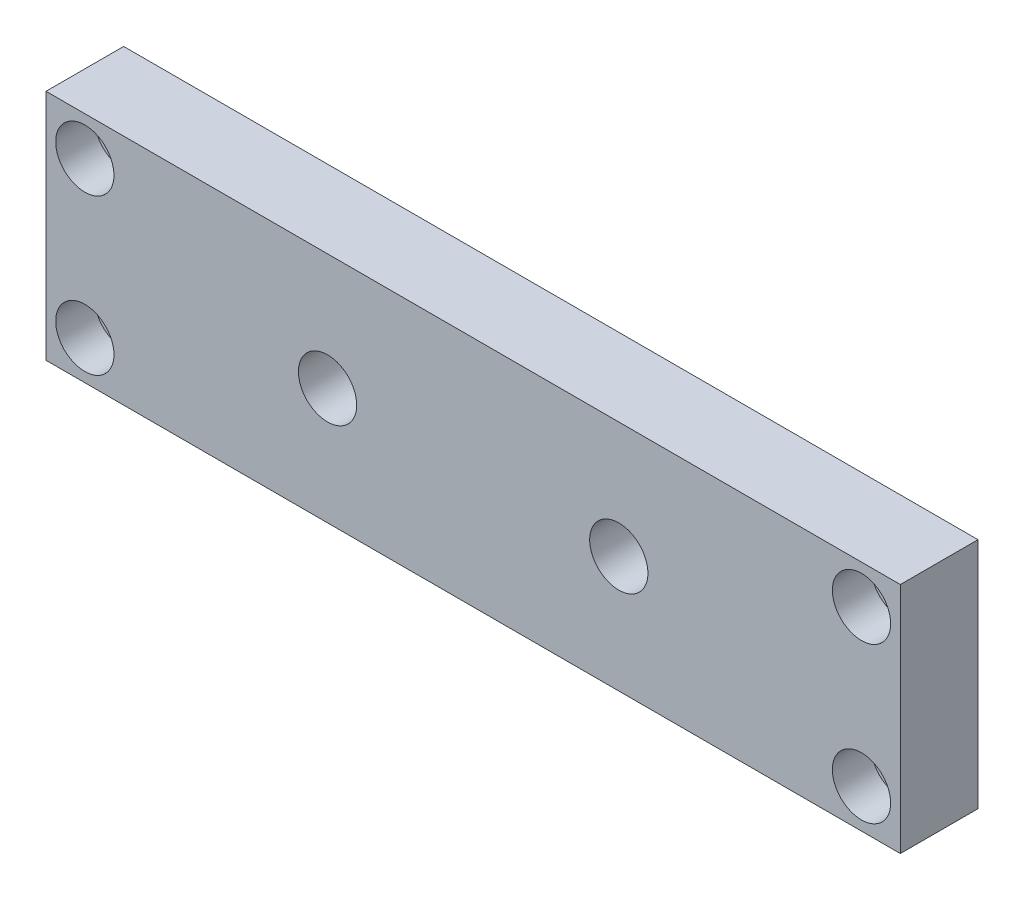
ISO-10303-21;
HEADER;
FILE_DESCRIPTION(('STEP AP214'),'2;1');
FILE_NAME('part.step','',(''),(''),'','','');
FILE_SCHEMA(('AUTOMOTIVE_DESIGN { 1 0 10303 214 1 1 1 1 }'));
ENDSEC;
DATA;
#1=APPLICATION_CONTEXT('core data for automotive mechanical design processes');
#2=APPLICATION_PROTOCOL_DEFINITION('international standard','automotive_design',2000,#1);
#3=PRODUCT_CONTEXT('',#1,'mechanical');
#4=PRODUCT('Part','Part','',(#3));
#5=PRODUCT_RELATED_PRODUCT_CATEGORY('part','',(#4));
#6=PRODUCT_DEFINITION_FORMATION('','',#4);
#7=PRODUCT_DEFINITION_CONTEXT('part definition',#1,'design');
#8=PRODUCT_DEFINITION('design','',#6,#7);
#9=PRODUCT_DEFINITION_SHAPE('','',#8);
#10=(LENGTH_UNIT() NAMED_UNIT(*) SI_UNIT(.MILLI.,.METRE.));
#11=(NAMED_UNIT(*) PLANE_ANGLE_UNIT() SI_UNIT($,.RADIAN.));
#12=(NAMED_UNIT(*) SI_UNIT($,.STERADIAN.) SOLID_ANGLE_UNIT());
#13=UNCERTAINTY_MEASURE_WITH_UNIT(LENGTH_MEASURE(1.E-05),#10,'distance_accuracy_value','');
#14=(GEOMETRIC_REPRESENTATION_CONTEXT(3) GLOBAL_UNCERTAINTY_ASSIGNED_CONTEXT((#13)) GLOBAL_UNIT_ASSIGNED_CONTEXT((#10,
#11,#12)) REPRESENTATION_CONTEXT('',''));
#15=CARTESIAN_POINT('',(0.,0.,0.));
#16=DIRECTION('',(0.,0.,1.));
#17=DIRECTION('',(1.,0.,0.));
#18=AXIS2_PLACEMENT_3D('',#15,#16,#17);
#19=CARTESIAN_POINT('',(63.5,12.7,12.7));
#20=DIRECTION('',(0.,0.,-1.));
#21=DIRECTION('',(-1.,0.,0.));
#22=AXIS2_PLACEMENT_3D('',#19,#20,#21);
#23=CYLINDRICAL_SURFACE('',#22,3.175);
#24=CARTESIAN_POINT('',(63.5,12.7,0.));
#25=DIRECTION('',(0.,0.,1.));
#26=DIRECTION('',(1.,0.,0.));
#27=AXIS2_PLACEMENT_3D('',#24,#25,#26);
#28=CIRCLE('',#27,3.175);
#29=CARTESIAN_POINT('',(66.675,12.7,0.));
#30=VERTEX_POINT('',#29);
#31=EDGE_CURVE('E214',#30,#30,#28,.T.);
#32=ORIENTED_EDGE('',*,*,#31,.F.);
#33=EDGE_LOOP('',(#32));
#34=FACE_BOUND('',#33,.T.);
#35=CARTESIAN_POINT('',(63.5,12.7,6.35));
#36=DIRECTION('',(0.,0.,1.));
#37=DIRECTION('',(1.,0.,0.));
#38=AXIS2_PLACEMENT_3D('',#35,#36,#37);
#39=CIRCLE('',#38,3.175);
#40=CARTESIAN_POINT('',(66.675,12.7,6.35));
#41=VERTEX_POINT('',#40);
#42=EDGE_CURVE('E127',#41,#41,#39,.T.);
#43=ORIENTED_EDGE('',*,*,#42,.T.);
#44=EDGE_LOOP('',(#43));
#45=FACE_BOUND('',#44,.T.);
#46=ADVANCED_FACE('F33',(#34,#45),#23,.F.);
#47=CARTESIAN_POINT('',(63.5,-12.7,12.7));
#48=DIRECTION('',(0.,0.,-1.));
#49=DIRECTION('',(-1.,0.,0.));
#50=AXIS2_PLACEMENT_3D('',#47,#48,#49);
#51=CYLINDRICAL_SURFACE('',#50,3.175);
#52=CARTESIAN_POINT('',(63.5,-12.7,0.));
#53=DIRECTION('',(0.,0.,1.));
#54=DIRECTION('',(1.,0.,0.));
#55=AXIS2_PLACEMENT_3D('',#52,#53,#54);
#56=CIRCLE('',#55,3.175);
#57=CARTESIAN_POINT('',(66.675,-12.7,0.));
#58=VERTEX_POINT('',#57);
#59=EDGE_CURVE('E197',#58,#58,#56,.T.);
#60=ORIENTED_EDGE('',*,*,#59,.F.);
#61=EDGE_LOOP('',(#60));
#62=FACE_BOUND('',#61,.T.);
#63=CARTESIAN_POINT('',(63.5,-12.7,6.35));
#64=DIRECTION('',(0.,0.,1.));
#65=DIRECTION('',(1.,0.,0.));
#66=AXIS2_PLACEMENT_3D('',#63,#64,#65);
#67=CIRCLE('',#66,3.175);
#68=CARTESIAN_POINT('',(66.675,-12.7,6.35));
#69=VERTEX_POINT('',#68);
#70=EDGE_CURVE('E122',#69,#69,#67,.T.);
#71=ORIENTED_EDGE('',*,*,#70,.T.);
#72=EDGE_LOOP('',(#71));
#73=FACE_BOUND('',#72,.T.);
#74=ADVANCED_FACE('F145',(#62,#73),#51,.F.);
#75=CARTESIAN_POINT('',(-63.5,-12.7,12.7));
#76=DIRECTION('',(0.,0.,-1.));
#77=DIRECTION('',(-1.,0.,0.));
#78=AXIS2_PLACEMENT_3D('',#75,#76,#77);
#79=CYLINDRICAL_SURFACE('',#78,3.175);
#80=CARTESIAN_POINT('',(-63.5,-12.7,0.));
#81=DIRECTION('',(0.,0.,1.));
#82=DIRECTION('',(1.,0.,0.));
#83=AXIS2_PLACEMENT_3D('',#80,#81,#82);
#84=CIRCLE('',#83,3.175);
#85=CARTESIAN_POINT('',(-60.325,-12.7,0.));
#86=VERTEX_POINT('',#85);
#87=EDGE_CURVE('E193',#86,#86,#84,.T.);
#88=ORIENTED_EDGE('',*,*,#87,.F.);
#89=EDGE_LOOP('',(#88));
#90=FACE_BOUND('',#89,.T.);
#91=CARTESIAN_POINT('',(-63.5,-12.7,6.35));
#92=DIRECTION('',(0.,0.,1.));
#93=DIRECTION('',(1.,0.,0.));
#94=AXIS2_PLACEMENT_3D('',#91,#92,#93);
#95=CIRCLE('',#94,3.175);
#96=CARTESIAN_POINT('',(-60.325,-12.7,6.35));
#97=VERTEX_POINT('',#96);
#98=EDGE_CURVE('E117',#97,#97,#95,.T.);
#99=ORIENTED_EDGE('',*,*,#98,.T.);
#100=EDGE_LOOP('',(#99));
#101=FACE_BOUND('',#100,.T.);
#102=ADVANCED_FACE('F152',(#90,#101),#79,.F.);
#103=CARTESIAN_POINT('',(-63.5,12.7,12.7));
#104=DIRECTION('',(0.,0.,-1.));
#105=DIRECTION('',(-1.,0.,0.));
#106=AXIS2_PLACEMENT_3D('',#103,#104,#105);
#107=CYLINDRICAL_SURFACE('',#106,3.175);
#108=CARTESIAN_POINT('',(-63.5,12.7,0.));
#109=DIRECTION('',(0.,0.,1.));
#110=DIRECTION('',(1.,0.,0.));
#111=AXIS2_PLACEMENT_3D('',#108,#109,#110);
#112=CIRCLE('',#111,3.175);
#113=CARTESIAN_POINT('',(-60.325,12.7,0.));
#114=VERTEX_POINT('',#113);
#115=EDGE_CURVE('E105',#114,#114,#112,.T.);
#116=ORIENTED_EDGE('',*,*,#115,.F.);
#117=EDGE_LOOP('',(#116));
#118=FACE_BOUND('',#117,.T.);
#119=CARTESIAN_POINT('',(-63.5,12.7,6.35));
#120=DIRECTION('',(0.,0.,1.));
#121=DIRECTION('',(1.,0.,0.));
#122=AXIS2_PLACEMENT_3D('',#119,#120,#121);
#123=CIRCLE('',#122,3.175);
#124=CARTESIAN_POINT('',(-60.325,12.7,6.35));
#125=VERTEX_POINT('',#124);
#126=EDGE_CURVE('E112',#125,#125,#123,.T.);
#127=ORIENTED_EDGE('',*,*,#126,.T.);
#128=EDGE_LOOP('',(#127));
#129=FACE_BOUND('',#128,.T.);
#130=ADVANCED_FACE('F161',(#118,#129),#107,.F.);
#131=CARTESIAN_POINT('',(0.,0.,12.7));
#132=DIRECTION('',(0.,0.,1.));
#133=DIRECTION('',(1.,0.,0.));
#134=AXIS2_PLACEMENT_3D('',#131,#132,#133);
#135=PLANE('',#134);
#136=CARTESIAN_POINT('',(63.5,12.7,12.7));
#137=DIRECTION('',(0.,0.,1.));
#138=DIRECTION('',(1.,0.,0.));
#139=AXIS2_PLACEMENT_3D('',#136,#137,#138);
#140=CIRCLE('',#139,4.7625);
#141=CARTESIAN_POINT('',(68.2625,12.7,12.7));
#142=VERTEX_POINT('',#141);
#143=EDGE_CURVE('E244',#142,#142,#140,.T.);
#144=ORIENTED_EDGE('',*,*,#143,.F.);
#145=EDGE_LOOP('',(#144));
#146=FACE_BOUND('',#145,.T.);
#147=CARTESIAN_POINT('',(63.5,-12.7,12.7));
#148=DIRECTION('',(0.,0.,1.));
#149=DIRECTION('',(1.,0.,0.));
#150=AXIS2_PLACEMENT_3D('',#147,#148,#149);
#151=CIRCLE('',#150,4.7625);
#152=CARTESIAN_POINT('',(68.2625,-12.7,12.7));
#153=VERTEX_POINT('',#152);
#154=EDGE_CURVE('E129',#153,#153,#151,.T.);
#155=ORIENTED_EDGE('',*,*,#154,.F.);
#156=EDGE_LOOP('',(#155));
#157=FACE_BOUND('',#156,.T.);
#158=CARTESIAN_POINT('',(-63.5,-12.7,12.7));
#159=DIRECTION('',(0.,0.,1.));
#160=DIRECTION('',(1.,0.,0.));
#161=AXIS2_PLACEMENT_3D('',#158,#159,#160);
#162=CIRCLE('',#161,4.7625);
#163=CARTESIAN_POINT('',(-58.7375,-12.7,12.7));
#164=VERTEX_POINT('',#163);
#165=EDGE_CURVE('E125',#164,#164,#162,.T.);
#166=ORIENTED_EDGE('',*,*,#165,.F.);
#167=EDGE_LOOP('',(#166));
#168=FACE_BOUND('',#167,.T.);
#169=CARTESIAN_POINT('',(-63.5,12.7,12.7));
#170=DIRECTION('',(0.,0.,1.));
#171=DIRECTION('',(1.,0.,0.));
#172=AXIS2_PLACEMENT_3D('',#169,#170,#171);
#173=CIRCLE('',#172,4.7625);
#174=CARTESIAN_POINT('',(-58.7375,12.7,12.7));
#175=VERTEX_POINT('',#174);
#176=EDGE_CURVE('E120',#175,#175,#173,.T.);
#177=ORIENTED_EDGE('',*,*,#176,.F.);
#178=EDGE_LOOP('',(#177));
#179=FACE_BOUND('',#178,.T.);
#180=CARTESIAN_POINT('',(-23.8125,0.,12.7));
#181=DIRECTION('',(0.,0.,1.));
#182=DIRECTION('',(1.,0.,0.));
#183=AXIS2_PLACEMENT_3D('',#180,#181,#182);
#184=CIRCLE('',#183,4.7625);
#185=CARTESIAN_POINT('',(-19.05,0.,12.7));
#186=VERTEX_POINT('',#185);
#187=EDGE_CURVE('E208',#186,#186,#184,.T.);
#188=ORIENTED_EDGE('',*,*,#187,.F.);
#189=EDGE_LOOP('',(#188));
#190=FACE_BOUND('',#189,.T.);
#191=DIRECTION('',(0.,-1.,0.));
#192=VECTOR('',#191,1.);
#193=CARTESIAN_POINT('',(-69.85,19.05,12.7));
#194=LINE('',#193,#192);
#195=CARTESIAN_POINT('',(-69.85,19.05,12.7));
#196=VERTEX_POINT('',#195);
#197=CARTESIAN_POINT('',(-69.85,-19.05,12.7));
#198=VERTEX_POINT('',#197);
#199=EDGE_CURVE('E87',#196,#198,#194,.T.);
#200=ORIENTED_EDGE('',*,*,#199,.T.);
#201=DIRECTION('',(1.,0.,0.));
#202=VECTOR('',#201,1.);
#203=CARTESIAN_POINT('',(-69.85,-19.05,12.7));
#204=LINE('',#203,#202);
#205=CARTESIAN_POINT('',(69.85,-19.05,12.7));
#206=VERTEX_POINT('',#205);
#207=EDGE_CURVE('E81',#198,#206,#204,.T.);
#208=ORIENTED_EDGE('',*,*,#207,.T.);
#209=DIRECTION('',(0.,1.,0.));
#210=VECTOR('',#209,1.);
#211=CARTESIAN_POINT('',(69.85,-19.05,12.7));
#212=LINE('',#211,#210);
#213=CARTESIAN_POINT('',(69.85,19.05,12.7));
#214=VERTEX_POINT('',#213);
#215=EDGE_CURVE('E85',#206,#214,#212,.T.);
#216=ORIENTED_EDGE('',*,*,#215,.T.);
#217=DIRECTION('',(-1.,0.,0.));
#218=VECTOR('',#217,1.);
#219=CARTESIAN_POINT('',(69.85,19.05,12.7));
#220=LINE('',#219,#218);
#221=EDGE_CURVE('E50',#214,#196,#220,.T.);
#222=ORIENTED_EDGE('',*,*,#221,.T.);
#223=EDGE_LOOP('',(#200,#208,#216,#222));
#224=FACE_BOUND('',#223,.T.);
#225=CARTESIAN_POINT('',(23.8125,0.,12.7));
#226=DIRECTION('',(0.,0.,1.));
#227=DIRECTION('',(1.,0.,0.));
#228=AXIS2_PLACEMENT_3D('',#225,#226,#227);
#229=CIRCLE('',#228,4.7625);
#230=CARTESIAN_POINT('',(28.575,0.,12.7));
#231=VERTEX_POINT('',#230);
#232=EDGE_CURVE('E201',#231,#231,#229,.T.);
#233=ORIENTED_EDGE('',*,*,#232,.F.);
#234=EDGE_LOOP('',(#233));
#235=FACE_BOUND('',#234,.T.);
#236=ADVANCED_FACE('F82',(#146,#157,#168,#179,#190,#224,#235),#135,.T.);
#237=CARTESIAN_POINT('',(0.,0.,0.));
#238=DIRECTION('',(0.,0.,1.));
#239=DIRECTION('',(1.,0.,0.));
#240=AXIS2_PLACEMENT_3D('',#237,#238,#239);
#241=PLANE('',#240);
#242=CARTESIAN_POINT('',(-23.8125,0.,0.));
#243=DIRECTION('',(0.,0.,1.));
#244=DIRECTION('',(1.,0.,0.));
#245=AXIS2_PLACEMENT_3D('',#242,#243,#244);
#246=CIRCLE('',#245,4.7625);
#247=CARTESIAN_POINT('',(-19.05,0.,0.));
#248=VERTEX_POINT('',#247);
#249=EDGE_CURVE('E204',#248,#248,#246,.T.);
#250=ORIENTED_EDGE('',*,*,#249,.T.);
#251=EDGE_LOOP('',(#250));
#252=FACE_BOUND('',#251,.T.);
#253=ORIENTED_EDGE('',*,*,#31,.T.);
#254=EDGE_LOOP('',(#253));
#255=FACE_BOUND('',#254,.T.);
#256=ORIENTED_EDGE('',*,*,#115,.T.);
#257=EDGE_LOOP('',(#256));
#258=FACE_BOUND('',#257,.T.);
#259=DIRECTION('',(0.,-1.,0.));
#260=VECTOR('',#259,1.);
#261=CARTESIAN_POINT('',(-69.85,19.05,0.));
#262=LINE('',#261,#260);
#263=CARTESIAN_POINT('',(-69.85,19.05,0.));
#264=VERTEX_POINT('',#263);
#265=CARTESIAN_POINT('',(-69.85,-19.05,0.));
#266=VERTEX_POINT('',#265);
#267=EDGE_CURVE('E102',#264,#266,#262,.T.);
#268=ORIENTED_EDGE('',*,*,#267,.F.);
#269=DIRECTION('',(-1.,0.,0.));
#270=VECTOR('',#269,1.);
#271=CARTESIAN_POINT('',(69.85,19.05,0.));
#272=LINE('',#271,#270);
#273=CARTESIAN_POINT('',(69.85,19.05,0.));
#274=VERTEX_POINT('',#273);
#275=EDGE_CURVE('E73',#274,#264,#272,.T.);
#276=ORIENTED_EDGE('',*,*,#275,.F.);
#277=DIRECTION('',(0.,1.,0.));
#278=VECTOR('',#277,1.);
#279=CARTESIAN_POINT('',(69.85,-19.05,0.));
#280=LINE('',#279,#278);
#281=CARTESIAN_POINT('',(69.85,-19.05,0.));
#282=VERTEX_POINT('',#281);
#283=EDGE_CURVE('E67',#282,#274,#280,.T.);
#284=ORIENTED_EDGE('',*,*,#283,.F.);
#285=DIRECTION('',(1.,0.,0.));
#286=VECTOR('',#285,1.);
#287=CARTESIAN_POINT('',(-69.85,-19.05,0.));
#288=LINE('',#287,#286);
#289=EDGE_CURVE('E92',#266,#282,#288,.T.);
#290=ORIENTED_EDGE('',*,*,#289,.F.);
#291=EDGE_LOOP('',(#268,#276,#284,#290));
#292=FACE_BOUND('',#291,.T.);
#293=ORIENTED_EDGE('',*,*,#87,.T.);
#294=EDGE_LOOP('',(#293));
#295=FACE_BOUND('',#294,.T.);
#296=ORIENTED_EDGE('',*,*,#59,.T.);
#297=EDGE_LOOP('',(#296));
#298=FACE_BOUND('',#297,.T.);
#299=CARTESIAN_POINT('',(23.8125,0.,0.));
#300=DIRECTION('',(0.,0.,1.));
#301=DIRECTION('',(1.,0.,0.));
#302=AXIS2_PLACEMENT_3D('',#299,#300,#301);
#303=CIRCLE('',#302,4.7625);
#304=CARTESIAN_POINT('',(28.575,0.,0.));
#305=VERTEX_POINT('',#304);
#306=EDGE_CURVE('E115',#305,#305,#303,.T.);
#307=ORIENTED_EDGE('',*,*,#306,.T.);
#308=EDGE_LOOP('',(#307));
#309=FACE_BOUND('',#308,.T.);
#310=ADVANCED_FACE('F168',(#252,#255,#258,#292,#295,#298,#309),#241,.F.);
#311=CARTESIAN_POINT('',(-69.85,19.05,12.7));
#312=DIRECTION('',(1.,0.,0.));
#313=DIRECTION('',(0.,0.,-1.));
#314=AXIS2_PLACEMENT_3D('',#311,#312,#313);
#315=PLANE('',#314);
#316=ORIENTED_EDGE('',*,*,#267,.T.);
#317=DIRECTION('',(0.,0.,-1.));
#318=VECTOR('',#317,1.);
#319=CARTESIAN_POINT('',(-69.85,-19.05,12.7));
#320=LINE('',#319,#318);
#321=EDGE_CURVE('E93',#198,#266,#320,.T.);
#322=ORIENTED_EDGE('',*,*,#321,.F.);
#323=ORIENTED_EDGE('',*,*,#199,.F.);
#324=DIRECTION('',(0.,0.,-1.));
#325=VECTOR('',#324,1.);
#326=CARTESIAN_POINT('',(-69.85,19.05,12.7));
#327=LINE('',#326,#325);
#328=EDGE_CURVE('E98',#196,#264,#327,.T.);
#329=ORIENTED_EDGE('',*,*,#328,.T.);
#330=EDGE_LOOP('',(#316,#322,#323,#329));
#331=FACE_BOUND('',#330,.T.);
#332=ADVANCED_FACE('F172',(#331),#315,.F.);
#333=CARTESIAN_POINT('',(-69.85,-19.05,12.7));
#334=DIRECTION('',(0.,1.,0.));
#335=DIRECTION('',(0.,0.,1.));
#336=AXIS2_PLACEMENT_3D('',#333,#334,#335);
#337=PLANE('',#336);
#338=CARTESIAN_POINT('',(0.,-19.05,6.35));
#339=DIRECTION('',(0.,-1.,0.));
#340=DIRECTION('',(0.,0.,-1.));
#341=AXIS2_PLACEMENT_3D('',#338,#339,#340);
#342=CIRCLE('',#341,3.175);
#343=CARTESIAN_POINT('',(0.,-19.05,3.175));
#344=VERTEX_POINT('',#343);
#345=EDGE_CURVE('E247',#344,#344,#342,.T.);
#346=ORIENTED_EDGE('',*,*,#345,.F.);
#347=EDGE_LOOP('',(#346));
#348=FACE_BOUND('',#347,.T.);
#349=ORIENTED_EDGE('',*,*,#289,.T.);
#350=DIRECTION('',(0.,0.,-1.));
#351=VECTOR('',#350,1.);
#352=CARTESIAN_POINT('',(69.85,-19.05,12.7));
#353=LINE('',#352,#351);
#354=EDGE_CURVE('E90',#206,#282,#353,.T.);
#355=ORIENTED_EDGE('',*,*,#354,.F.);
#356=ORIENTED_EDGE('',*,*,#207,.F.);
#357=ORIENTED_EDGE('',*,*,#321,.T.);
#358=EDGE_LOOP('',(#349,#355,#356,#357));
#359=FACE_BOUND('',#358,.T.);
#360=ADVANCED_FACE('F91',(#348,#359),#337,.F.);
#361=CARTESIAN_POINT('',(69.85,-19.05,12.7));
#362=DIRECTION('',(-1.,0.,0.));
#363=DIRECTION('',(0.,0.,1.));
#364=AXIS2_PLACEMENT_3D('',#361,#362,#363);
#365=PLANE('',#364);
#366=ORIENTED_EDGE('',*,*,#283,.T.);
#367=DIRECTION('',(0.,0.,-1.));
#368=VECTOR('',#367,1.);
#369=CARTESIAN_POINT('',(69.85,19.05,12.7));
#370=LINE('',#369,#368);
#371=EDGE_CURVE('E94',#214,#274,#370,.T.);
#372=ORIENTED_EDGE('',*,*,#371,.F.);
#373=ORIENTED_EDGE('',*,*,#215,.F.);
#374=ORIENTED_EDGE('',*,*,#354,.T.);
#375=EDGE_LOOP('',(#366,#372,#373,#374));
#376=FACE_BOUND('',#375,.T.);
#377=ADVANCED_FACE('F96',(#376),#365,.F.);
#378=CARTESIAN_POINT('',(69.85,19.05,12.7));
#379=DIRECTION('',(0.,-1.,0.));
#380=DIRECTION('',(0.,0.,-1.));
#381=AXIS2_PLACEMENT_3D('',#378,#379,#380);
#382=PLANE('',#381);
#383=ORIENTED_EDGE('',*,*,#275,.T.);
#384=ORIENTED_EDGE('',*,*,#328,.F.);
#385=ORIENTED_EDGE('',*,*,#221,.F.);
#386=ORIENTED_EDGE('',*,*,#371,.T.);
#387=EDGE_LOOP('',(#383,#384,#385,#386));
#388=FACE_BOUND('',#387,.T.);
#389=ADVANCED_FACE('F174',(#388),#382,.F.);
#390=CARTESIAN_POINT('',(-23.8125,0.,12.7));
#391=DIRECTION('',(0.,0.,-1.));
#392=DIRECTION('',(-1.,0.,0.));
#393=AXIS2_PLACEMENT_3D('',#390,#391,#392);
#394=CYLINDRICAL_SURFACE('',#393,4.7625);
#395=ORIENTED_EDGE('',*,*,#187,.T.);
#396=EDGE_LOOP('',(#395));
#397=FACE_BOUND('',#396,.T.);
#398=ORIENTED_EDGE('',*,*,#249,.F.);
#399=EDGE_LOOP('',(#398));
#400=FACE_BOUND('',#399,.T.);
#401=ADVANCED_FACE('F177',(#397,#400),#394,.F.);
#402=CARTESIAN_POINT('',(23.8125,0.,12.7));
#403=DIRECTION('',(0.,0.,-1.));
#404=DIRECTION('',(-1.,0.,0.));
#405=AXIS2_PLACEMENT_3D('',#402,#403,#404);
#406=CYLINDRICAL_SURFACE('',#405,4.7625);
#407=ORIENTED_EDGE('',*,*,#232,.T.);
#408=EDGE_LOOP('',(#407));
#409=FACE_BOUND('',#408,.T.);
#410=ORIENTED_EDGE('',*,*,#306,.F.);
#411=EDGE_LOOP('',(#410));
#412=FACE_BOUND('',#411,.T.);
#413=ADVANCED_FACE('F284',(#409,#412),#406,.F.);
#414=CARTESIAN_POINT('',(-63.5,12.7,6.35));
#415=DIRECTION('',(0.,0.,1.));
#416=DIRECTION('',(1.,0.,0.));
#417=AXIS2_PLACEMENT_3D('',#414,#415,#416);
#418=CYLINDRICAL_SURFACE('',#417,4.7625);
#419=CARTESIAN_POINT('',(-63.5,12.7,6.35));
#420=DIRECTION('',(0.,0.,1.));
#421=DIRECTION('',(1.,0.,0.));
#422=AXIS2_PLACEMENT_3D('',#419,#420,#421);
#423=CIRCLE('',#422,4.7625);
#424=CARTESIAN_POINT('',(-58.7375,12.7,6.35));
#425=VERTEX_POINT('',#424);
#426=EDGE_CURVE('E116',#425,#425,#423,.T.);
#427=ORIENTED_EDGE('',*,*,#426,.F.);
#428=EDGE_LOOP('',(#427));
#429=FACE_BOUND('',#428,.T.);
#430=ORIENTED_EDGE('',*,*,#176,.T.);
#431=EDGE_LOOP('',(#430));
#432=FACE_BOUND('',#431,.T.);
#433=ADVANCED_FACE('F228',(#429,#432),#418,.F.);
#434=CARTESIAN_POINT('',(-63.5,12.7,6.35));
#435=DIRECTION('',(0.,0.,1.));
#436=DIRECTION('',(1.,0.,0.));
#437=AXIS2_PLACEMENT_3D('',#434,#435,#436);
#438=PLANE('',#437);
#439=ORIENTED_EDGE('',*,*,#126,.F.);
#440=EDGE_LOOP('',(#439));
#441=FACE_BOUND('',#440,.T.);
#442=ORIENTED_EDGE('',*,*,#426,.T.);
#443=EDGE_LOOP('',(#442));
#444=FACE_BOUND('',#443,.T.);
#445=ADVANCED_FACE('F224',(#441,#444),#438,.T.);
#446=CARTESIAN_POINT('',(-63.5,-12.7,6.35));
#447=DIRECTION('',(0.,0.,1.));
#448=DIRECTION('',(1.,0.,0.));
#449=AXIS2_PLACEMENT_3D('',#446,#447,#448);
#450=CYLINDRICAL_SURFACE('',#449,4.7625);
#451=CARTESIAN_POINT('',(-63.5,-12.7,6.35));
#452=DIRECTION('',(0.,0.,1.));
#453=DIRECTION('',(1.,0.,0.));
#454=AXIS2_PLACEMENT_3D('',#451,#452,#453);
#455=CIRCLE('',#454,4.7625);
#456=CARTESIAN_POINT('',(-58.7375,-12.7,6.35));
#457=VERTEX_POINT('',#456);
#458=EDGE_CURVE('E121',#457,#457,#455,.T.);
#459=ORIENTED_EDGE('',*,*,#458,.F.);
#460=EDGE_LOOP('',(#459));
#461=FACE_BOUND('',#460,.T.);
#462=ORIENTED_EDGE('',*,*,#165,.T.);
#463=EDGE_LOOP('',(#462));
#464=FACE_BOUND('',#463,.T.);
#465=ADVANCED_FACE('F227',(#461,#464),#450,.F.);
#466=CARTESIAN_POINT('',(-63.5,-12.7,6.35));
#467=DIRECTION('',(0.,0.,1.));
#468=DIRECTION('',(1.,0.,0.));
#469=AXIS2_PLACEMENT_3D('',#466,#467,#468);
#470=PLANE('',#469);
#471=ORIENTED_EDGE('',*,*,#98,.F.);
#472=EDGE_LOOP('',(#471));
#473=FACE_BOUND('',#472,.T.);
#474=ORIENTED_EDGE('',*,*,#458,.T.);
#475=EDGE_LOOP('',(#474));
#476=FACE_BOUND('',#475,.T.);
#477=ADVANCED_FACE('F274',(#473,#476),#470,.T.);
#478=CARTESIAN_POINT('',(63.5,-12.7,6.35));
#479=DIRECTION('',(0.,0.,1.));
#480=DIRECTION('',(1.,0.,0.));
#481=AXIS2_PLACEMENT_3D('',#478,#479,#480);
#482=CYLINDRICAL_SURFACE('',#481,4.7625);
#483=CARTESIAN_POINT('',(63.5,-12.7,6.35));
#484=DIRECTION('',(0.,0.,1.));
#485=DIRECTION('',(1.,0.,0.));
#486=AXIS2_PLACEMENT_3D('',#483,#484,#485);
#487=CIRCLE('',#486,4.7625);
#488=CARTESIAN_POINT('',(68.2625,-12.7,6.35));
#489=VERTEX_POINT('',#488);
#490=EDGE_CURVE('E126',#489,#489,#487,.T.);
#491=ORIENTED_EDGE('',*,*,#490,.F.);
#492=EDGE_LOOP('',(#491));
#493=FACE_BOUND('',#492,.T.);
#494=ORIENTED_EDGE('',*,*,#154,.T.);
#495=EDGE_LOOP('',(#494));
#496=FACE_BOUND('',#495,.T.);
#497=ADVANCED_FACE('F270',(#493,#496),#482,.F.);
#498=CARTESIAN_POINT('',(63.5,-12.7,6.35));
#499=DIRECTION('',(0.,0.,1.));
#500=DIRECTION('',(1.,0.,0.));
#501=AXIS2_PLACEMENT_3D('',#498,#499,#500);
#502=PLANE('',#501);
#503=ORIENTED_EDGE('',*,*,#70,.F.);
#504=EDGE_LOOP('',(#503));
#505=FACE_BOUND('',#504,.T.);
#506=ORIENTED_EDGE('',*,*,#490,.T.);
#507=EDGE_LOOP('',(#506));
#508=FACE_BOUND('',#507,.T.);
#509=ADVANCED_FACE('F266',(#505,#508),#502,.T.);
#510=CARTESIAN_POINT('',(63.5,12.7,6.35));
#511=DIRECTION('',(0.,0.,1.));
#512=DIRECTION('',(1.,0.,0.));
#513=AXIS2_PLACEMENT_3D('',#510,#511,#512);
#514=CYLINDRICAL_SURFACE('',#513,4.7625);
#515=CARTESIAN_POINT('',(63.5,12.7,6.35));
#516=DIRECTION('',(0.,0.,1.));
#517=DIRECTION('',(1.,0.,0.));
#518=AXIS2_PLACEMENT_3D('',#515,#516,#517);
#519=CIRCLE('',#518,4.7625);
#520=CARTESIAN_POINT('',(68.2625,12.7,6.35));
#521=VERTEX_POINT('',#520);
#522=EDGE_CURVE('E130',#521,#521,#519,.T.);
#523=ORIENTED_EDGE('',*,*,#522,.F.);
#524=EDGE_LOOP('',(#523));
#525=FACE_BOUND('',#524,.T.);
#526=ORIENTED_EDGE('',*,*,#143,.T.);
#527=EDGE_LOOP('',(#526));
#528=FACE_BOUND('',#527,.T.);
#529=ADVANCED_FACE('F260',(#525,#528),#514,.F.);
#530=CARTESIAN_POINT('',(63.5,12.7,6.35));
#531=DIRECTION('',(0.,0.,1.));
#532=DIRECTION('',(1.,0.,0.));
#533=AXIS2_PLACEMENT_3D('',#530,#531,#532);
#534=PLANE('',#533);
#535=ORIENTED_EDGE('',*,*,#42,.F.);
#536=EDGE_LOOP('',(#535));
#537=FACE_BOUND('',#536,.T.);
#538=ORIENTED_EDGE('',*,*,#522,.T.);
#539=EDGE_LOOP('',(#538));
#540=FACE_BOUND('',#539,.T.);
#541=ADVANCED_FACE('F254',(#537,#540),#534,.T.);
#542=CARTESIAN_POINT('',(0.,1.27,6.35));
#543=DIRECTION('',(0.,-1.,0.));
#544=DIRECTION('',(0.,0.,-1.));
#545=AXIS2_PLACEMENT_3D('',#542,#543,#544);
#546=CYLINDRICAL_SURFACE('',#545,3.175);
#547=CARTESIAN_POINT('',(0.,-0.507999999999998,6.35));
#548=DIRECTION('',(0.,-1.,0.));
#549=DIRECTION('',(0.,0.,-1.));
#550=AXIS2_PLACEMENT_3D('',#547,#548,#549);
#551=CIRCLE('',#550,3.175);
#552=CARTESIAN_POINT('',(0.,-0.507999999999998,3.175));
#553=VERTEX_POINT('',#552);
#554=EDGE_CURVE('E11',#553,#553,#551,.F.);
#555=ORIENTED_EDGE('',*,*,#554,.T.);
#556=EDGE_LOOP('',(#555));
#557=FACE_BOUND('',#556,.T.);
#558=ORIENTED_EDGE('',*,*,#345,.T.);
#559=EDGE_LOOP('',(#558));
#560=FACE_BOUND('',#559,.T.);
#561=ADVANCED_FACE('F141',(#557,#560),#546,.F.);
#562=CARTESIAN_POINT('',(0.,1.27,6.35));
#563=DIRECTION('',(0.,-1.,0.));
#564=DIRECTION('',(0.,0.,-1.));
#565=AXIS2_PLACEMENT_3D('',#562,#563,#564);
#566=PLANE('',#565);
#567=CARTESIAN_POINT('',(0.,1.27,6.35));
#568=DIRECTION('',(0.,-1.,0.));
#569=DIRECTION('',(0.,0.,-1.));
#570=AXIS2_PLACEMENT_3D('',#567,#568,#569);
#571=CIRCLE('',#570,0.215911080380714);
#572=CARTESIAN_POINT('',(0.,1.27,6.13408891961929));
#573=VERTEX_POINT('',#572);
#574=EDGE_CURVE('E42',#573,#573,#571,.T.);
#575=ORIENTED_EDGE('',*,*,#574,.T.);
#576=EDGE_LOOP('',(#575));
#577=FACE_BOUND('',#576,.T.);
#578=ADVANCED_FACE('F134',(#577),#566,.T.);
#579=CARTESIAN_POINT('',(0.,1.27,6.35));
#580=DIRECTION('',(0.,-1.,0.));
#581=DIRECTION('',(0.,0.,-1.));
#582=AXIS2_PLACEMENT_3D('',#579,#580,#581);
#583=CONICAL_SURFACE('',#582,0.215911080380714,1.02974425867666);
#584=CARTESIAN_POINT('',(0.,-0.507999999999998,3.175));
#585=CARTESIAN_POINT('',(0.,-0.489479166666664,3.2058238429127));
#586=CARTESIAN_POINT('',(0.,-0.470958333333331,3.2366476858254));
#587=CARTESIAN_POINT('',(0.,-0.433916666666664,3.2982953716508));
#588=CARTESIAN_POINT('',(0.,-0.415395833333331,3.3291192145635));
#589=CARTESIAN_POINT('',(0.,-0.378354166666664,3.39076690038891));
#590=CARTESIAN_POINT('',(0.,-0.359833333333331,3.42159074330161));
#591=CARTESIAN_POINT('',(0.,-0.322791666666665,3.48323842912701));
#592=CARTESIAN_POINT('',(0.,-0.304270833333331,3.51406227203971));
#593=CARTESIAN_POINT('',(0.,-0.267229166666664,3.57570995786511));
#594=CARTESIAN_POINT('',(0.,-0.248708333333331,3.60653380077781));
#595=CARTESIAN_POINT('',(0.,-0.211666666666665,3.66818148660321));
#596=CARTESIAN_POINT('',(0.,-0.193145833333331,3.69900532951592));
#597=CARTESIAN_POINT('',(0.,-0.156104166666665,3.76065301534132));
#598=CARTESIAN_POINT('',(0.,-0.137583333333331,3.79147685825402));
#599=CARTESIAN_POINT('',(0.,-0.100541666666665,3.85312454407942));
#600=CARTESIAN_POINT('',(0.,-0.0820208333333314,3.88394838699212));
#601=CARTESIAN_POINT('',(0.,-0.0449791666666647,3.94559607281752));
#602=CARTESIAN_POINT('',(0.,-0.0264583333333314,3.97641991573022));
#603=CARTESIAN_POINT('',(0.,0.0105833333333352,4.03806760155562));
#604=CARTESIAN_POINT('',(0.,0.0291041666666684,4.06889144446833));
#605=CARTESIAN_POINT('',(0.,0.066145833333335,4.13053913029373));
#606=CARTESIAN_POINT('',(0.,0.0846666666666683,4.16136297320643));
#607=CARTESIAN_POINT('',(0.,0.121708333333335,4.22301065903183));
#608=CARTESIAN_POINT('',(0.,0.140229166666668,4.25383450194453));
#609=CARTESIAN_POINT('',(0.,0.177270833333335,4.31548218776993));
#610=CARTESIAN_POINT('',(0.,0.195791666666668,4.34630603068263));
#611=CARTESIAN_POINT('',(0.,0.232833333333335,4.40795371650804));
#612=CARTESIAN_POINT('',(0.,0.251354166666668,4.43877755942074));
#613=CARTESIAN_POINT('',(0.,0.288395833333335,4.50042524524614));
#614=CARTESIAN_POINT('',(0.,0.306916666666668,4.53124908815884));
#615=CARTESIAN_POINT('',(0.,0.343958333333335,4.59289677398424));
#616=CARTESIAN_POINT('',(0.,0.362479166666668,4.62372061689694));
#617=CARTESIAN_POINT('',(0.,0.399520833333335,4.68536830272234));
#618=CARTESIAN_POINT('',(0.,0.418041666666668,4.71619214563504));
#619=CARTESIAN_POINT('',(0.,0.455083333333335,4.77783983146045));
#620=CARTESIAN_POINT('',(0.,0.473604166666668,4.80866367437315));
#621=CARTESIAN_POINT('',(0.,0.510645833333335,4.87031136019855));
#622=CARTESIAN_POINT('',(0.,0.529166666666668,4.90113520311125));
#623=CARTESIAN_POINT('',(0.,0.566208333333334,4.96278288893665));
#624=CARTESIAN_POINT('',(0.,0.584729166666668,4.99360673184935));
#625=CARTESIAN_POINT('',(0.,0.621770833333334,5.05525441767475));
#626=CARTESIAN_POINT('',(0.,0.640291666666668,5.08607826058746));
#627=CARTESIAN_POINT('',(0.,0.677333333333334,5.14772594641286));
#628=CARTESIAN_POINT('',(0.,0.695854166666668,5.17854978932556));
#629=CARTESIAN_POINT('',(0.,0.732895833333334,5.24019747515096));
#630=CARTESIAN_POINT('',(0.,0.751416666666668,5.27102131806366));
#631=CARTESIAN_POINT('',(0.,0.788458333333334,5.33266900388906));
#632=CARTESIAN_POINT('',(0.,0.806979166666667,5.36349284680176));
#633=CARTESIAN_POINT('',(0.,0.844020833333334,5.42514053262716));
#634=CARTESIAN_POINT('',(0.,0.862541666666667,5.45596437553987));
#635=CARTESIAN_POINT('',(0.,0.899583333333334,5.51761206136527));
#636=CARTESIAN_POINT('',(0.,0.918104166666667,5.54843590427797));
#637=CARTESIAN_POINT('',(0.,0.955145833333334,5.61008359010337));
#638=CARTESIAN_POINT('',(0.,0.973666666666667,5.64090743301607));
#639=CARTESIAN_POINT('',(0.,1.01070833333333,5.70255511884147));
#640=CARTESIAN_POINT('',(0.,1.02922916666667,5.73337896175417));
#641=CARTESIAN_POINT('',(0.,1.06627083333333,5.79502664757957));
#642=CARTESIAN_POINT('',(0.,1.08479166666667,5.82585049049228));
#643=CARTESIAN_POINT('',(0.,1.12183333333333,5.88749817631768));
#644=CARTESIAN_POINT('',(0.,1.14035416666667,5.91832201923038));
#645=CARTESIAN_POINT('',(0.,1.17739583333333,5.97996970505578));
#646=CARTESIAN_POINT('',(0.,1.19591666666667,6.01079354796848));
#647=CARTESIAN_POINT('',(0.,1.23295833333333,6.07244123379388));
#648=CARTESIAN_POINT('',(0.,1.25147916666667,6.10326507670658));
#649=CARTESIAN_POINT('',(0.,1.27,6.13408891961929));
#650=B_SPLINE_CURVE_WITH_KNOTS('',3,(#584,#585,#586,#587,#588,#589,#590,#591,#592,#593,#594,
#595,#596,#597,#598,#599,#600,#601,#602,#603,#604,#605,#606,#607,#608,#609,#610,#611,#612,#613,
#614,#615,#616,#617,#618,#619,#620,#621,#622,#623,#624,#625,#626,#627,#628,#629,#630,#631,#632,
#633,#634,#635,#636,#637,#638,#639,#640,#641,#642,#643,#644,#645,#646,#647,#648,#649),
.UNSPECIFIED.,.F.,.F.,(4,2,2,2,2,2,2,2,2,2,2,2,2,2,2,2,2,2,2,2,2,2,2,2,2,2,2,2,2,2,2,2,4),(0.,
0.107880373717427,0.215760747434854,0.323641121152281,0.431521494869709,0.539401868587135,
0.647282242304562,0.75516261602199,0.863042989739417,0.970923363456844,1.07880373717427,
1.1866841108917,1.29456448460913,1.40244485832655,1.51032523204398,1.61820560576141,
1.72608597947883,1.83396635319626,1.94184672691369,2.04972710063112,2.15760747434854,
2.26548784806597,2.3733682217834,2.48124859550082,2.58912896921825,2.69700934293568,
2.80488971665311,2.91277009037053,3.02065046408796,3.12853083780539,3.23641121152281,
3.34429158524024,3.45217195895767),.UNSPECIFIED.);
#651=EDGE_CURVE('BSEAM35',#553,#573,#650,.T.);
#652=ORIENTED_EDGE('',*,*,#554,.F.);
#653=ORIENTED_EDGE('',*,*,#574,.F.);
#654=ORIENTED_EDGE('',*,*,#651,.T.);
#655=ORIENTED_EDGE('',*,*,#651,.F.);
#656=EDGE_LOOP('',(#652,#654,#653,#655));
#657=FACE_BOUND('',#656,.T.);
#658=ADVANCED_FACE('F35',(#657),#583,.F.);
#659=CLOSED_SHELL('',(#46,#74,#102,#130,#236,#310,#332,#360,#377,#389,#401,#413,#433,#445,#465,
#477,#497,#509,#529,#541,#561,#578,#658));
#660=MANIFOLD_SOLID_BREP('B2',#659);
#661=ADVANCED_BREP_SHAPE_REPRESENTATION('',(#18,#660),#14);
#662=SHAPE_DEFINITION_REPRESENTATION(#9,#661);
ENDSEC;
END-ISO-10303-21;
